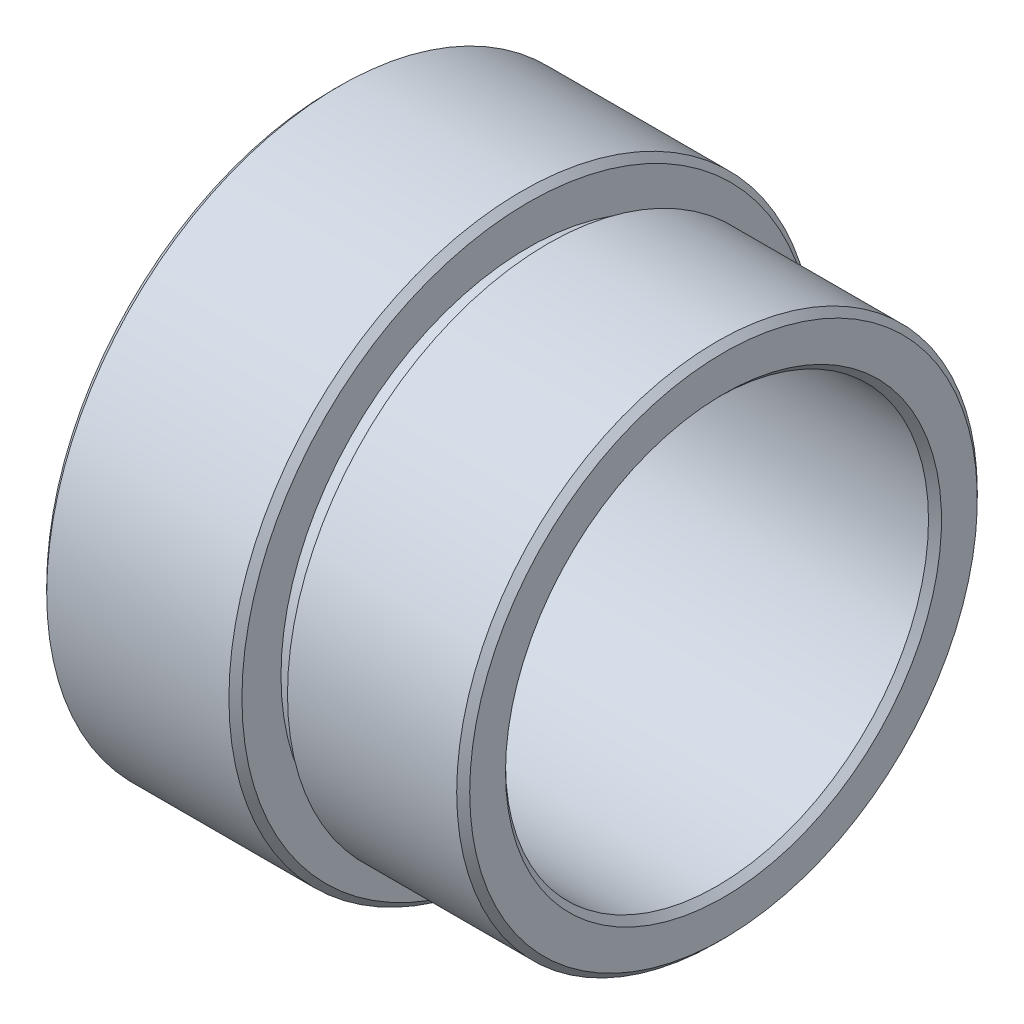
from build123d import *

# Parameters (mm, degrees)
CHANFREIN1_SIZE         = 1
ESQUISSE2_OUTSIDE_W     = 120.142
ESQUISSE2_OUTSIDE_H     = 120.142
ESQUISSE2_OUTSIDE_R     = 38
ENL_V_MAT_EXTRU_1_DEPTH = 3


with BuildPart() as part:
    # Esquisse1 → R_volution1 (revolve)
    with BuildSketch(Plane.XY, mode=Mode.PRIVATE) as r_volution1_sk:
        Polygon((11.92608157, 45), (11.92608157, 32.5), (71.92608157, 32.5), (71.92608157, 40), (41.92608157, 40), (41.92608157, 45), align=None)
    revolve(r_volution1_sk.sketch.rotate(Axis((0, 0, 0), (1, 0, 0)), 90), axis=Axis((0, 0, 0), (1, 0, 0)))

    # Chanfrein1
    chanfrein1_edges = [part.edges().sort_by_distance(p)[0] for p in [
        (11.92608157, 0, -45),
        (11.92608157, 0, -32.5),
        (71.92608157, 0, -32.5),
        (71.92608157, 0, -40),
        (41.92608157, 0, -45),
    ]]
    chamfer(chanfrein1_edges, length=CHANFREIN1_SIZE)

    # Esquisse2 outside → Enl_v. mat.-Extru.1 (cut)
    with BuildSketch(Plane(origin=(41.92608157, 0, 0), x_dir=(0, 0, -1), z_dir=(1, 0, 0))):
        Rectangle(ESQUISSE2_OUTSIDE_W, ESQUISSE2_OUTSIDE_H)
        Circle(ESQUISSE2_OUTSIDE_R, mode=Mode.SUBTRACT)
    extrude(amount=ENL_V_MAT_EXTRU_1_DEPTH, mode=Mode.SUBTRACT)


solid = part.part
